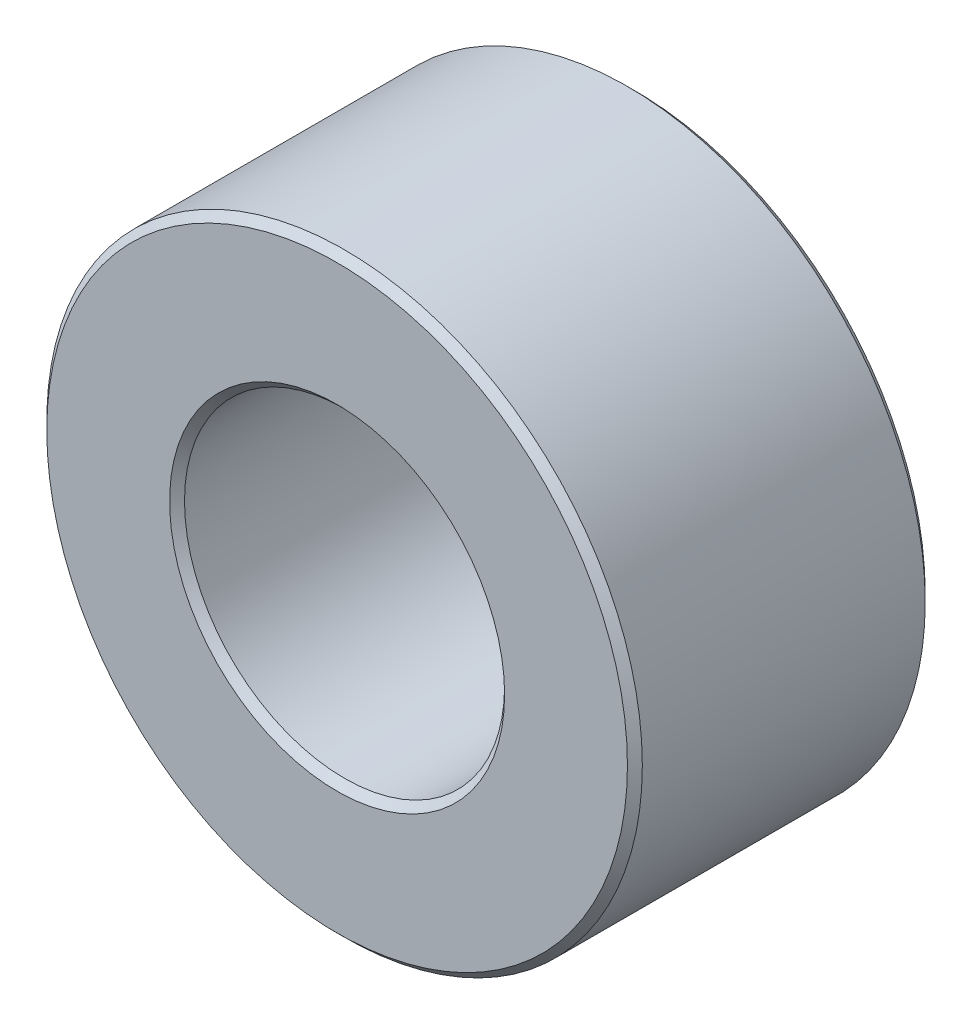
ISO-10303-21;
HEADER;
FILE_DESCRIPTION(('STEP AP214'),'2;1');
FILE_NAME('part.step','',(''),(''),'','','');
FILE_SCHEMA(('AUTOMOTIVE_DESIGN { 1 0 10303 214 1 1 1 1 }'));
ENDSEC;
DATA;
#1=APPLICATION_CONTEXT('core data for automotive mechanical design processes');
#2=APPLICATION_PROTOCOL_DEFINITION('international standard','automotive_design',2000,#1);
#3=PRODUCT_CONTEXT('',#1,'mechanical');
#4=PRODUCT('Part','Part','',(#3));
#5=PRODUCT_RELATED_PRODUCT_CATEGORY('part','',(#4));
#6=PRODUCT_DEFINITION_FORMATION('','',#4);
#7=PRODUCT_DEFINITION_CONTEXT('part definition',#1,'design');
#8=PRODUCT_DEFINITION('design','',#6,#7);
#9=PRODUCT_DEFINITION_SHAPE('','',#8);
#10=(LENGTH_UNIT() NAMED_UNIT(*) SI_UNIT(.MILLI.,.METRE.));
#11=(NAMED_UNIT(*) PLANE_ANGLE_UNIT() SI_UNIT($,.RADIAN.));
#12=(NAMED_UNIT(*) SI_UNIT($,.STERADIAN.) SOLID_ANGLE_UNIT());
#13=UNCERTAINTY_MEASURE_WITH_UNIT(LENGTH_MEASURE(1.E-05),#10,'distance_accuracy_value','');
#14=(GEOMETRIC_REPRESENTATION_CONTEXT(3) GLOBAL_UNCERTAINTY_ASSIGNED_CONTEXT((#13)) GLOBAL_UNIT_ASSIGNED_CONTEXT((#10,
#11,#12)) REPRESENTATION_CONTEXT('',''));
#15=CARTESIAN_POINT('',(0.,0.,0.));
#16=DIRECTION('',(0.,0.,1.));
#17=DIRECTION('',(1.,0.,0.));
#18=AXIS2_PLACEMENT_3D('',#15,#16,#17);
#19=CARTESIAN_POINT('',(0.,0.,2.));
#20=DIRECTION('',(0.,0.,1.));
#21=DIRECTION('',(1.,0.,0.));
#22=AXIS2_PLACEMENT_3D('',#19,#20,#21);
#23=PLANE('',#22);
#24=CARTESIAN_POINT('',(0.,0.,2.));
#25=DIRECTION('',(0.,0.,1.));
#26=DIRECTION('',(1.,0.,0.));
#27=AXIS2_PLACEMENT_3D('',#24,#25,#26);
#28=CIRCLE('',#27,2.25);
#29=CARTESIAN_POINT('',(2.25,0.,2.));
#30=VERTEX_POINT('',#29);
#31=EDGE_CURVE('E10',#30,#30,#28,.F.);
#32=ORIENTED_EDGE('',*,*,#31,.T.);
#33=EDGE_LOOP('',(#32));
#34=FACE_BOUND('',#33,.T.);
#35=CARTESIAN_POINT('',(0.,0.,2.));
#36=DIRECTION('',(0.,0.,1.));
#37=DIRECTION('',(1.,0.,0.));
#38=AXIS2_PLACEMENT_3D('',#35,#36,#37);
#39=CIRCLE('',#38,3.9);
#40=CARTESIAN_POINT('',(3.9,0.,2.));
#41=VERTEX_POINT('',#40);
#42=EDGE_CURVE('E45',#41,#41,#39,.T.);
#43=ORIENTED_EDGE('',*,*,#42,.T.);
#44=EDGE_LOOP('',(#43));
#45=FACE_BOUND('',#44,.T.);
#46=ADVANCED_FACE('F37',(#34,#45),#23,.T.);
#47=CARTESIAN_POINT('',(0.,0.,-2.));
#48=DIRECTION('',(0.,0.,1.));
#49=DIRECTION('',(1.,0.,0.));
#50=AXIS2_PLACEMENT_3D('',#47,#48,#49);
#51=PLANE('',#50);
#52=CARTESIAN_POINT('',(0.,0.,-2.));
#53=DIRECTION('',(0.,0.,1.));
#54=DIRECTION('',(1.,0.,0.));
#55=AXIS2_PLACEMENT_3D('',#52,#53,#54);
#56=CIRCLE('',#55,3.9);
#57=CARTESIAN_POINT('',(3.9,0.,-2.));
#58=VERTEX_POINT('',#57);
#59=EDGE_CURVE('E63',#58,#58,#56,.F.);
#60=ORIENTED_EDGE('',*,*,#59,.T.);
#61=EDGE_LOOP('',(#60));
#62=FACE_BOUND('',#61,.T.);
#63=CARTESIAN_POINT('',(0.,0.,-2.));
#64=DIRECTION('',(0.,0.,1.));
#65=DIRECTION('',(1.,0.,0.));
#66=AXIS2_PLACEMENT_3D('',#63,#64,#65);
#67=CIRCLE('',#66,2.25);
#68=CARTESIAN_POINT('',(-2.25,0.,-2.));
#69=VERTEX_POINT('',#68);
#70=EDGE_CURVE('E67',#69,#69,#67,.T.);
#71=ORIENTED_EDGE('',*,*,#70,.T.);
#72=EDGE_LOOP('',(#71));
#73=FACE_BOUND('',#72,.T.);
#74=ADVANCED_FACE('F89',(#62,#73),#51,.F.);
#75=CARTESIAN_POINT('',(0.,0.,2.));
#76=DIRECTION('',(0.,0.,-1.));
#77=DIRECTION('',(-1.,0.,0.));
#78=AXIS2_PLACEMENT_3D('',#75,#76,#77);
#79=CYLINDRICAL_SURFACE('',#78,4.);
#80=CARTESIAN_POINT('',(0.,0.,-1.9));
#81=DIRECTION('',(0.,0.,1.));
#82=DIRECTION('',(1.,0.,0.));
#83=AXIS2_PLACEMENT_3D('',#80,#81,#82);
#84=CIRCLE('',#83,4.);
#85=CARTESIAN_POINT('',(4.,0.,-1.9));
#86=VERTEX_POINT('',#85);
#87=EDGE_CURVE('E71',#86,#86,#84,.T.);
#88=ORIENTED_EDGE('',*,*,#87,.T.);
#89=EDGE_LOOP('',(#88));
#90=FACE_BOUND('',#89,.T.);
#91=CARTESIAN_POINT('',(0.,0.,1.9));
#92=DIRECTION('',(0.,0.,1.));
#93=DIRECTION('',(1.,0.,0.));
#94=AXIS2_PLACEMENT_3D('',#91,#92,#93);
#95=CIRCLE('',#94,4.);
#96=CARTESIAN_POINT('',(4.,0.,1.9));
#97=VERTEX_POINT('',#96);
#98=EDGE_CURVE('E74',#97,#97,#95,.F.);
#99=ORIENTED_EDGE('',*,*,#98,.T.);
#100=EDGE_LOOP('',(#99));
#101=FACE_BOUND('',#100,.T.);
#102=ADVANCED_FACE('F78',(#90,#101),#79,.T.);
#103=CARTESIAN_POINT('',(0.,0.,2.));
#104=DIRECTION('',(0.,0.,-1.));
#105=DIRECTION('',(-1.,0.,0.));
#106=AXIS2_PLACEMENT_3D('',#103,#104,#105);
#107=CYLINDRICAL_SURFACE('',#106,2.15);
#108=CARTESIAN_POINT('',(0.,0.,-1.9));
#109=DIRECTION('',(0.,0.,1.));
#110=DIRECTION('',(1.,0.,0.));
#111=AXIS2_PLACEMENT_3D('',#108,#109,#110);
#112=CIRCLE('',#111,2.15);
#113=CARTESIAN_POINT('',(-2.15,0.,-1.9));
#114=VERTEX_POINT('',#113);
#115=EDGE_CURVE('E51',#114,#114,#112,.F.);
#116=ORIENTED_EDGE('',*,*,#115,.T.);
#117=EDGE_LOOP('',(#116));
#118=FACE_BOUND('',#117,.T.);
#119=CARTESIAN_POINT('',(0.,0.,1.9));
#120=DIRECTION('',(0.,0.,1.));
#121=DIRECTION('',(1.,0.,0.));
#122=AXIS2_PLACEMENT_3D('',#119,#120,#121);
#123=CIRCLE('',#122,2.15);
#124=CARTESIAN_POINT('',(2.15,0.,1.9));
#125=VERTEX_POINT('',#124);
#126=EDGE_CURVE('E57',#125,#125,#123,.T.);
#127=ORIENTED_EDGE('',*,*,#126,.T.);
#128=EDGE_LOOP('',(#127));
#129=FACE_BOUND('',#128,.T.);
#130=ADVANCED_FACE('F97',(#118,#129),#107,.F.);
#131=CARTESIAN_POINT('',(0.,0.,-1.9));
#132=DIRECTION('',(0.,0.,1.));
#133=DIRECTION('',(1.,0.,0.));
#134=AXIS2_PLACEMENT_3D('',#131,#132,#133);
#135=CONICAL_SURFACE('',#134,4.,0.785398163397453);
#136=ORIENTED_EDGE('',*,*,#59,.F.);
#137=EDGE_LOOP('',(#136));
#138=FACE_BOUND('',#137,.T.);
#139=ORIENTED_EDGE('',*,*,#87,.F.);
#140=EDGE_LOOP('',(#139));
#141=FACE_BOUND('',#140,.T.);
#142=ADVANCED_FACE('F102',(#138,#141),#135,.T.);
#143=CARTESIAN_POINT('',(0.,0.,-2.));
#144=DIRECTION('',(0.,0.,-1.));
#145=DIRECTION('',(-1.,0.,0.));
#146=AXIS2_PLACEMENT_3D('',#143,#144,#145);
#147=CONICAL_SURFACE('',#146,2.25,0.785398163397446);
#148=CARTESIAN_POINT('',(-2.15,0.,-1.9));
#149=CARTESIAN_POINT('',(-2.15104166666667,0.,-1.90104166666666));
#150=CARTESIAN_POINT('',(-2.15208333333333,0.,-1.90208333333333));
#151=CARTESIAN_POINT('',(-2.15416666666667,0.,-1.90416666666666));
#152=CARTESIAN_POINT('',(-2.15520833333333,0.,-1.90520833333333));
#153=CARTESIAN_POINT('',(-2.15729166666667,0.,-1.90729166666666));
#154=CARTESIAN_POINT('',(-2.15833333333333,0.,-1.90833333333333));
#155=CARTESIAN_POINT('',(-2.16041666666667,0.,-1.91041666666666));
#156=CARTESIAN_POINT('',(-2.16145833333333,0.,-1.91145833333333));
#157=CARTESIAN_POINT('',(-2.16354166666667,0.,-1.91354166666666));
#158=CARTESIAN_POINT('',(-2.16458333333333,0.,-1.91458333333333));
#159=CARTESIAN_POINT('',(-2.16666666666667,0.,-1.91666666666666));
#160=CARTESIAN_POINT('',(-2.16770833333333,0.,-1.91770833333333));
#161=CARTESIAN_POINT('',(-2.16979166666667,0.,-1.91979166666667));
#162=CARTESIAN_POINT('',(-2.17083333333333,0.,-1.92083333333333));
#163=CARTESIAN_POINT('',(-2.17291666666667,0.,-1.92291666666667));
#164=CARTESIAN_POINT('',(-2.17395833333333,0.,-1.92395833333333));
#165=CARTESIAN_POINT('',(-2.17604166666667,0.,-1.92604166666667));
#166=CARTESIAN_POINT('',(-2.17708333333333,0.,-1.92708333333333));
#167=CARTESIAN_POINT('',(-2.17916666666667,0.,-1.92916666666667));
#168=CARTESIAN_POINT('',(-2.18020833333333,0.,-1.93020833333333));
#169=CARTESIAN_POINT('',(-2.18229166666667,0.,-1.93229166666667));
#170=CARTESIAN_POINT('',(-2.18333333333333,0.,-1.93333333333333));
#171=CARTESIAN_POINT('',(-2.18541666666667,0.,-1.93541666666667));
#172=CARTESIAN_POINT('',(-2.18645833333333,0.,-1.93645833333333));
#173=CARTESIAN_POINT('',(-2.18854166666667,0.,-1.93854166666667));
#174=CARTESIAN_POINT('',(-2.18958333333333,0.,-1.93958333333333));
#175=CARTESIAN_POINT('',(-2.19166666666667,0.,-1.94166666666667));
#176=CARTESIAN_POINT('',(-2.19270833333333,0.,-1.94270833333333));
#177=CARTESIAN_POINT('',(-2.19479166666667,0.,-1.94479166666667));
#178=CARTESIAN_POINT('',(-2.19583333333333,0.,-1.94583333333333));
#179=CARTESIAN_POINT('',(-2.19791666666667,0.,-1.94791666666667));
#180=CARTESIAN_POINT('',(-2.19895833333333,0.,-1.94895833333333));
#181=CARTESIAN_POINT('',(-2.20104166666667,0.,-1.95104166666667));
#182=CARTESIAN_POINT('',(-2.20208333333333,0.,-1.95208333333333));
#183=CARTESIAN_POINT('',(-2.20416666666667,0.,-1.95416666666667));
#184=CARTESIAN_POINT('',(-2.20520833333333,0.,-1.95520833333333));
#185=CARTESIAN_POINT('',(-2.20729166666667,0.,-1.95729166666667));
#186=CARTESIAN_POINT('',(-2.20833333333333,0.,-1.95833333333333));
#187=CARTESIAN_POINT('',(-2.21041666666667,0.,-1.96041666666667));
#188=CARTESIAN_POINT('',(-2.21145833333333,0.,-1.96145833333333));
#189=CARTESIAN_POINT('',(-2.21354166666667,0.,-1.96354166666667));
#190=CARTESIAN_POINT('',(-2.21458333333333,0.,-1.96458333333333));
#191=CARTESIAN_POINT('',(-2.21666666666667,0.,-1.96666666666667));
#192=CARTESIAN_POINT('',(-2.21770833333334,0.,-1.96770833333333));
#193=CARTESIAN_POINT('',(-2.21979166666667,0.,-1.96979166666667));
#194=CARTESIAN_POINT('',(-2.22083333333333,0.,-1.97083333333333));
#195=CARTESIAN_POINT('',(-2.22291666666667,0.,-1.97291666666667));
#196=CARTESIAN_POINT('',(-2.22395833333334,0.,-1.97395833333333));
#197=CARTESIAN_POINT('',(-2.22604166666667,0.,-1.97604166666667));
#198=CARTESIAN_POINT('',(-2.22708333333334,0.,-1.97708333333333));
#199=CARTESIAN_POINT('',(-2.22916666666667,0.,-1.97916666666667));
#200=CARTESIAN_POINT('',(-2.23020833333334,0.,-1.98020833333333));
#201=CARTESIAN_POINT('',(-2.23229166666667,0.,-1.98229166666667));
#202=CARTESIAN_POINT('',(-2.23333333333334,0.,-1.98333333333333));
#203=CARTESIAN_POINT('',(-2.23541666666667,0.,-1.98541666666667));
#204=CARTESIAN_POINT('',(-2.23645833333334,0.,-1.98645833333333));
#205=CARTESIAN_POINT('',(-2.23854166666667,0.,-1.98854166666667));
#206=CARTESIAN_POINT('',(-2.23958333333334,0.,-1.98958333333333));
#207=CARTESIAN_POINT('',(-2.24166666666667,0.,-1.99166666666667));
#208=CARTESIAN_POINT('',(-2.24270833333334,0.,-1.99270833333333));
#209=CARTESIAN_POINT('',(-2.24479166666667,0.,-1.99479166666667));
#210=CARTESIAN_POINT('',(-2.24583333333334,0.,-1.99583333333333));
#211=CARTESIAN_POINT('',(-2.24791666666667,0.,-1.99791666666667));
#212=CARTESIAN_POINT('',(-2.24895833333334,0.,-1.99895833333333));
#213=CARTESIAN_POINT('',(-2.25,0.,-2.));
#214=B_SPLINE_CURVE_WITH_KNOTS('',3,(#148,#149,#150,#151,#152,#153,#154,#155,#156,#157,#158,
#159,#160,#161,#162,#163,#164,#165,#166,#167,#168,#169,#170,#171,#172,#173,#174,#175,#176,#177,
#178,#179,#180,#181,#182,#183,#184,#185,#186,#187,#188,#189,#190,#191,#192,#193,#194,#195,#196,
#197,#198,#199,#200,#201,#202,#203,#204,#205,#206,#207,#208,#209,#210,#211,#212,#213),
.UNSPECIFIED.,.F.,.F.,(4,2,2,2,2,2,2,2,2,2,2,2,2,2,2,2,2,2,2,2,2,2,2,2,2,2,2,2,2,2,2,2,4),(0.,
0.0044194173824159,0.00883883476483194,0.013258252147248,0.017677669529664,0.0220970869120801,
0.0265165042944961,0.0309359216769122,0.0353553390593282,0.0397747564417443,0.0441941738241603,
0.0486135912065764,0.0530330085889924,0.0574524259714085,0.0618718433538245,0.0662912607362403,
0.0707106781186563,0.0751300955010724,0.0795495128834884,0.0839689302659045,0.0883883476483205,
0.0928077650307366,0.0972271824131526,0.101646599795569,0.106066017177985,0.110485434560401,
0.114904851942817,0.119324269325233,0.123743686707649,0.128163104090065,0.132582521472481,
0.137001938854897,0.141421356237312),.UNSPECIFIED.);
#215=EDGE_CURVE('BSEAM86',#114,#69,#214,.T.);
#216=ORIENTED_EDGE('',*,*,#115,.F.);
#217=ORIENTED_EDGE('',*,*,#70,.F.);
#218=ORIENTED_EDGE('',*,*,#215,.T.);
#219=ORIENTED_EDGE('',*,*,#215,.F.);
#220=EDGE_LOOP('',(#216,#218,#217,#219));
#221=FACE_BOUND('',#220,.T.);
#222=ADVANCED_FACE('F86',(#221),#147,.F.);
#223=CARTESIAN_POINT('',(0.,0.,1.9));
#224=DIRECTION('',(0.,0.,1.));
#225=DIRECTION('',(1.,0.,0.));
#226=AXIS2_PLACEMENT_3D('',#223,#224,#225);
#227=CONICAL_SURFACE('',#226,2.15,0.78539816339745);
#228=ORIENTED_EDGE('',*,*,#31,.F.);
#229=EDGE_LOOP('',(#228));
#230=FACE_BOUND('',#229,.T.);
#231=ORIENTED_EDGE('',*,*,#126,.F.);
#232=EDGE_LOOP('',(#231));
#233=FACE_BOUND('',#232,.T.);
#234=ADVANCED_FACE('F82',(#230,#233),#227,.F.);
#235=CARTESIAN_POINT('',(0.,0.,2.));
#236=DIRECTION('',(0.,0.,-1.));
#237=DIRECTION('',(-1.,0.,0.));
#238=AXIS2_PLACEMENT_3D('',#235,#236,#237);
#239=CONICAL_SURFACE('',#238,3.9,0.785398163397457);
#240=ORIENTED_EDGE('',*,*,#98,.F.);
#241=EDGE_LOOP('',(#240));
#242=FACE_BOUND('',#241,.T.);
#243=ORIENTED_EDGE('',*,*,#42,.F.);
#244=EDGE_LOOP('',(#243));
#245=FACE_BOUND('',#244,.T.);
#246=ADVANCED_FACE('F39',(#242,#245),#239,.T.);
#247=CLOSED_SHELL('',(#46,#74,#102,#130,#142,#222,#234,#246));
#248=MANIFOLD_SOLID_BREP('B2',#247);
#249=ADVANCED_BREP_SHAPE_REPRESENTATION('',(#18,#248),#14);
#250=SHAPE_DEFINITION_REPRESENTATION(#9,#249);
ENDSEC;
END-ISO-10303-21;
